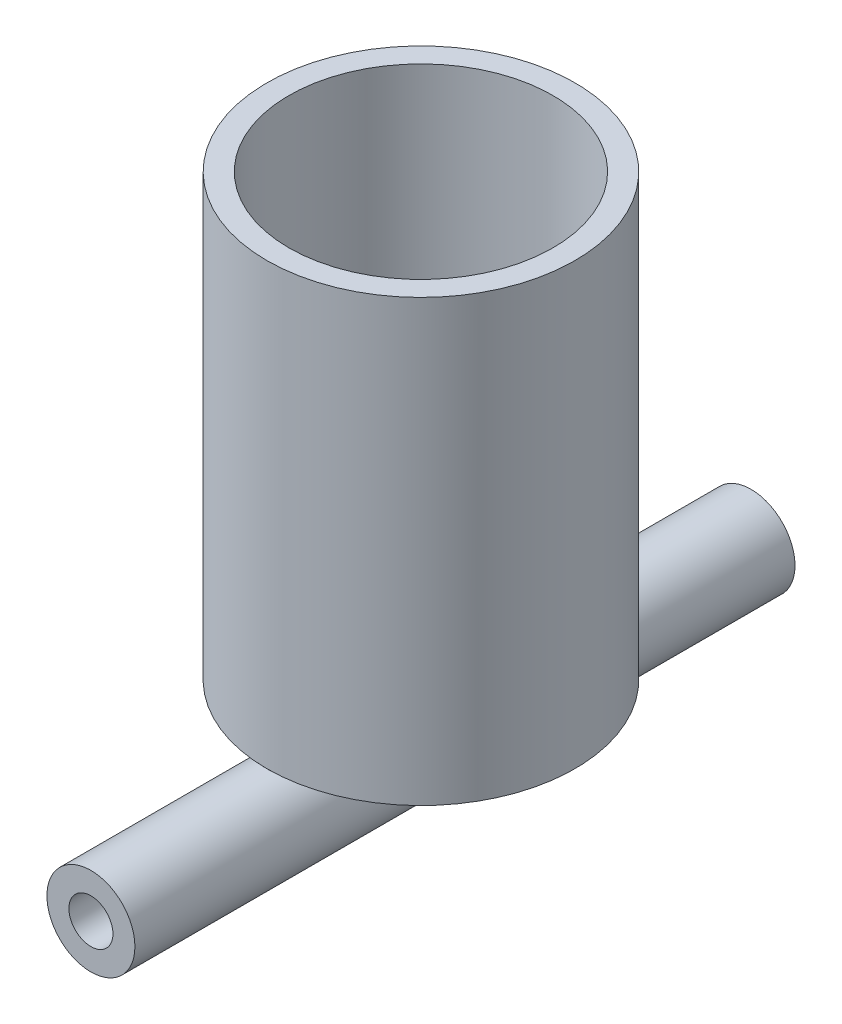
from build123d import *
from build123d.topology import SkipClean

# Parameters (mm, degrees)
SKETCH1_R           = 70
SKETCH1_R_2         = 59.99999999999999
BOSS_EXTRUDE1_DEPTH = 200
SKETCH2_R           = 20.000000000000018
SKETCH2_R_2         = 10.00000000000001
BOSS_EXTRUDE2_DEPTH = 150


with BuildPart() as part:
    # Sketch1 → Boss-Extrude1 (new body)
    with BuildSketch(Plane(origin=(0, 0, 0), x_dir=(1, 0, 0), z_dir=(0, 1, 0))):
        with Locations(Location((0, 0, 0), (0, 0, 270))):
            Circle(SKETCH1_R)
        with Locations(Location((0, 0, 0), (0, 0, 270))):
            Circle(SKETCH1_R_2, mode=Mode.SUBTRACT)
    extrude(amount=BOSS_EXTRUDE1_DEPTH)



with BuildPart() as body_2:
    # Sketch2 → Boss-Extrude2 (new, symmetric)
    with BuildSketch(Plane.XY):
        with Locations((2.694e-14, -20.000000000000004)):
            Circle(SKETCH2_R)
        with Locations((2.694e-14, -20.000000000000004)):
            Circle(SKETCH2_R_2, mode=Mode.SUBTRACT)
    extrude(amount=BOSS_EXTRUDE2_DEPTH, both=True)


with BuildPart() as part_1:
    with SkipClean():  # the faces are left unmerged after this step: merging them gives an invalid solid
        add(part.part)

        add(body_2.part)  # Revolve2 merges body 2
        # Sketch3 → Revolve2 (revolve)
        with BuildSketch(Plane.XY):
            with BuildLine():
                Line((69.99999999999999, 0), (10.633553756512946, -36.93893545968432))
                ThreePointArc((10.633553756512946, -36.93893545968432), (17.659776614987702, -29.38787994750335), (19.989106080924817, -19.339971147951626))
                Line((19.989106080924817, -19.339971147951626), (51.0713596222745, -8.7e-16))
                Line((51.0713596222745, -8.7e-16), (69.99999999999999, 0))
            make_face()
        revolve(axis=Axis((2.694e-14, 0, 0), (0, -1, 0)))


solid = part_1.part
